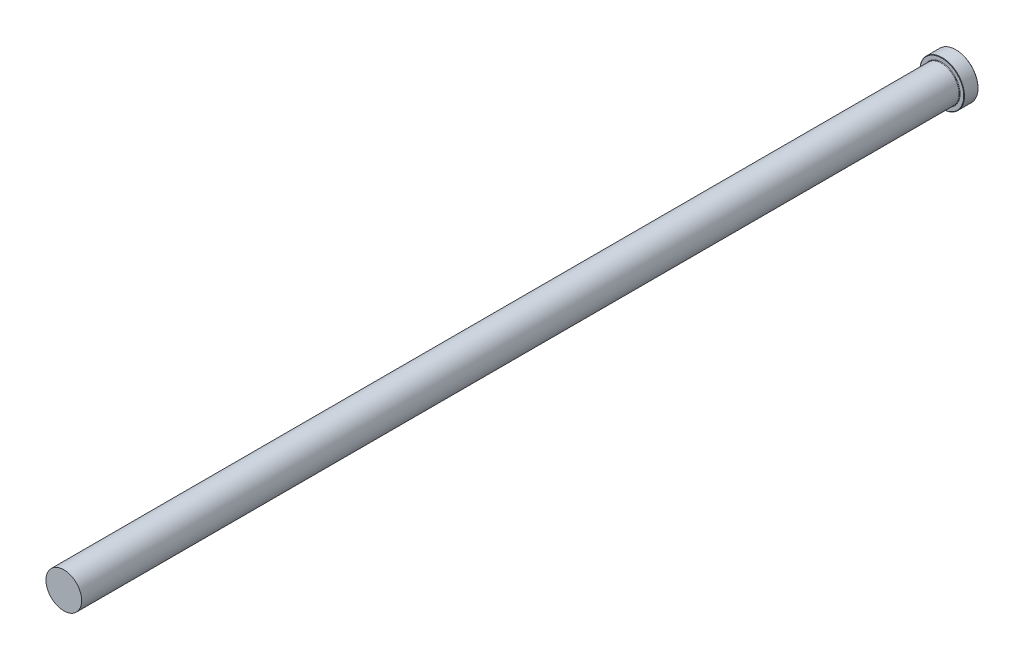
ISO-10303-21;
HEADER;
FILE_DESCRIPTION(('STEP AP214'),'2;1');
FILE_NAME('part.step','',(''),(''),'','','');
FILE_SCHEMA(('AUTOMOTIVE_DESIGN { 1 0 10303 214 1 1 1 1 }'));
ENDSEC;
DATA;
#1=APPLICATION_CONTEXT('core data for automotive mechanical design processes');
#2=APPLICATION_PROTOCOL_DEFINITION('international standard','automotive_design',2000,#1);
#3=PRODUCT_CONTEXT('',#1,'mechanical');
#4=PRODUCT('Part','Part','',(#3));
#5=PRODUCT_RELATED_PRODUCT_CATEGORY('part','',(#4));
#6=PRODUCT_DEFINITION_FORMATION('','',#4);
#7=PRODUCT_DEFINITION_CONTEXT('part definition',#1,'design');
#8=PRODUCT_DEFINITION('design','',#6,#7);
#9=PRODUCT_DEFINITION_SHAPE('','',#8);
#10=(LENGTH_UNIT() NAMED_UNIT(*) SI_UNIT(.MILLI.,.METRE.));
#11=(NAMED_UNIT(*) PLANE_ANGLE_UNIT() SI_UNIT($,.RADIAN.));
#12=(NAMED_UNIT(*) SI_UNIT($,.STERADIAN.) SOLID_ANGLE_UNIT());
#13=UNCERTAINTY_MEASURE_WITH_UNIT(LENGTH_MEASURE(1.E-05),#10,'distance_accuracy_value','');
#14=(GEOMETRIC_REPRESENTATION_CONTEXT(3) GLOBAL_UNCERTAINTY_ASSIGNED_CONTEXT((#13)) GLOBAL_UNIT_ASSIGNED_CONTEXT((#10,
#11,#12)) REPRESENTATION_CONTEXT('',''));
#15=CARTESIAN_POINT('',(0.,0.,0.));
#16=DIRECTION('',(0.,0.,1.));
#17=DIRECTION('',(1.,0.,0.));
#18=AXIS2_PLACEMENT_3D('',#15,#16,#17);
#19=CARTESIAN_POINT('',(0.,9.99999999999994,500.));
#20=DIRECTION('',(0.,0.,-1.));
#21=DIRECTION('',(-1.,0.,0.));
#22=AXIS2_PLACEMENT_3D('',#19,#20,#21);
#23=PLANE('',#22);
#24=CARTESIAN_POINT('',(0.,0.,500.));
#25=DIRECTION('',(0.,0.,1.));
#26=DIRECTION('',(1.,0.,0.));
#27=AXIS2_PLACEMENT_3D('',#24,#25,#26);
#28=CIRCLE('',#27,9.99999999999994);
#29=CARTESIAN_POINT('',(9.99999999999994,0.,500.));
#30=VERTEX_POINT('',#29);
#31=EDGE_CURVE('E50',#30,#30,#28,.T.);
#32=ORIENTED_EDGE('',*,*,#31,.T.);
#33=EDGE_LOOP('',(#32));
#34=FACE_BOUND('',#33,.T.);
#35=ADVANCED_FACE('F30',(#34),#23,.F.);
#36=CARTESIAN_POINT('',(0.,0.,109.050628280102));
#37=DIRECTION('',(0.,0.,1.));
#38=DIRECTION('',(1.,0.,0.));
#39=AXIS2_PLACEMENT_3D('',#36,#37,#38);
#40=CYLINDRICAL_SURFACE('',#39,9.99999999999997);
#41=ORIENTED_EDGE('',*,*,#31,.F.);
#42=EDGE_LOOP('',(#41));
#43=FACE_BOUND('',#42,.T.);
#44=CARTESIAN_POINT('',(0.,0.,8.3));
#45=DIRECTION('',(0.,0.,1.));
#46=DIRECTION('',(1.,0.,0.));
#47=AXIS2_PLACEMENT_3D('',#44,#45,#46);
#48=CIRCLE('',#47,10.);
#49=CARTESIAN_POINT('',(10.,0.,8.3));
#50=VERTEX_POINT('',#49);
#51=EDGE_CURVE('E53',#50,#50,#48,.T.);
#52=ORIENTED_EDGE('',*,*,#51,.T.);
#53=EDGE_LOOP('',(#52));
#54=FACE_BOUND('',#53,.T.);
#55=ADVANCED_FACE('F73',(#43,#54),#40,.T.);
#56=CARTESIAN_POINT('',(0.,0.,8.3));
#57=DIRECTION('',(0.,0.,1.));
#58=DIRECTION('',(1.,0.,0.));
#59=AXIS2_PLACEMENT_3D('',#56,#57,#58);
#60=TOROIDAL_SURFACE('',#59,10.3,0.3);
#61=ORIENTED_EDGE('',*,*,#51,.F.);
#62=EDGE_LOOP('',(#61));
#63=FACE_BOUND('',#62,.T.);
#64=CARTESIAN_POINT('',(0.,0.,8.00000000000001));
#65=DIRECTION('',(0.,0.,1.));
#66=DIRECTION('',(1.,0.,0.));
#67=AXIS2_PLACEMENT_3D('',#64,#65,#66);
#68=CIRCLE('',#67,10.3);
#69=CARTESIAN_POINT('',(10.3,0.,8.00000000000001));
#70=VERTEX_POINT('',#69);
#71=EDGE_CURVE('E56',#70,#70,#68,.T.);
#72=ORIENTED_EDGE('',*,*,#71,.T.);
#73=EDGE_LOOP('',(#72));
#74=FACE_BOUND('',#73,.T.);
#75=ADVANCED_FACE('F60',(#63,#74),#60,.F.);
#76=CARTESIAN_POINT('',(0.,12.5,8.));
#77=DIRECTION('',(0.,0.,-1.));
#78=DIRECTION('',(-1.,0.,0.));
#79=AXIS2_PLACEMENT_3D('',#76,#77,#78);
#80=PLANE('',#79);
#81=CARTESIAN_POINT('',(0.,0.,8.));
#82=DIRECTION('',(0.,0.,-1.));
#83=DIRECTION('',(-1.,0.,0.));
#84=AXIS2_PLACEMENT_3D('',#81,#82,#83);
#85=CIRCLE('',#84,12.3000000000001);
#86=CARTESIAN_POINT('',(-12.3000000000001,0.,8.));
#87=VERTEX_POINT('',#86);
#88=EDGE_CURVE('E10',#87,#87,#85,.F.);
#89=ORIENTED_EDGE('',*,*,#88,.T.);
#90=EDGE_LOOP('',(#89));
#91=FACE_BOUND('',#90,.T.);
#92=ORIENTED_EDGE('',*,*,#71,.F.);
#93=EDGE_LOOP('',(#92));
#94=FACE_BOUND('',#93,.T.);
#95=ADVANCED_FACE('F62',(#91,#94),#80,.F.);
#96=CARTESIAN_POINT('',(0.,0.,109.050628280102));
#97=DIRECTION('',(0.,0.,1.));
#98=DIRECTION('',(1.,0.,0.));
#99=AXIS2_PLACEMENT_3D('',#96,#97,#98);
#100=CYLINDRICAL_SURFACE('',#99,12.5);
#101=CARTESIAN_POINT('',(0.,0.,0.200000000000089));
#102=DIRECTION('',(0.,0.,1.));
#103=DIRECTION('',(1.,0.,0.));
#104=AXIS2_PLACEMENT_3D('',#101,#102,#103);
#105=CIRCLE('',#104,12.5);
#106=CARTESIAN_POINT('',(12.5,0.,0.200000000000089));
#107=VERTEX_POINT('',#106);
#108=EDGE_CURVE('E41',#107,#107,#105,.T.);
#109=ORIENTED_EDGE('',*,*,#108,.T.);
#110=EDGE_LOOP('',(#109));
#111=FACE_BOUND('',#110,.T.);
#112=CARTESIAN_POINT('',(0.,0.,7.80000000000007));
#113=DIRECTION('',(0.,0.,-1.));
#114=DIRECTION('',(-1.,0.,0.));
#115=AXIS2_PLACEMENT_3D('',#112,#113,#114);
#116=CIRCLE('',#115,12.5);
#117=CARTESIAN_POINT('',(-12.5,0.,7.80000000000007));
#118=VERTEX_POINT('',#117);
#119=EDGE_CURVE('E45',#118,#118,#116,.T.);
#120=ORIENTED_EDGE('',*,*,#119,.T.);
#121=EDGE_LOOP('',(#120));
#122=FACE_BOUND('',#121,.T.);
#123=ADVANCED_FACE('F64',(#111,#122),#100,.T.);
#124=CARTESIAN_POINT('',(0.,0.,0.));
#125=DIRECTION('',(0.,0.,1.));
#126=DIRECTION('',(1.,0.,0.));
#127=AXIS2_PLACEMENT_3D('',#124,#125,#126);
#128=PLANE('',#127);
#129=CARTESIAN_POINT('',(0.,0.,0.));
#130=DIRECTION('',(0.,0.,1.));
#131=DIRECTION('',(1.,0.,0.));
#132=AXIS2_PLACEMENT_3D('',#129,#130,#131);
#133=CIRCLE('',#132,12.2999999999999);
#134=CARTESIAN_POINT('',(12.2999999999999,0.,0.));
#135=VERTEX_POINT('',#134);
#136=EDGE_CURVE('E37',#135,#135,#133,.F.);
#137=ORIENTED_EDGE('',*,*,#136,.T.);
#138=EDGE_LOOP('',(#137));
#139=FACE_BOUND('',#138,.T.);
#140=ADVANCED_FACE('F70',(#139),#128,.F.);
#141=CARTESIAN_POINT('',(0.,0.,0.200000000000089));
#142=DIRECTION('',(0.,0.,1.));
#143=DIRECTION('',(1.,0.,0.));
#144=AXIS2_PLACEMENT_3D('',#141,#142,#143);
#145=CONICAL_SURFACE('',#144,12.5,0.785398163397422);
#146=ORIENTED_EDGE('',*,*,#136,.F.);
#147=EDGE_LOOP('',(#146));
#148=FACE_BOUND('',#147,.T.);
#149=ORIENTED_EDGE('',*,*,#108,.F.);
#150=EDGE_LOOP('',(#149));
#151=FACE_BOUND('',#150,.T.);
#152=ADVANCED_FACE('F84',(#148,#151),#145,.T.);
#153=CARTESIAN_POINT('',(0.,0.,8.00000000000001));
#154=DIRECTION('',(0.,0.,-1.));
#155=DIRECTION('',(-1.,0.,0.));
#156=AXIS2_PLACEMENT_3D('',#153,#154,#155);
#157=CONICAL_SURFACE('',#156,12.3000000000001,0.785398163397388);
#158=ORIENTED_EDGE('',*,*,#119,.F.);
#159=EDGE_LOOP('',(#158));
#160=FACE_BOUND('',#159,.T.);
#161=ORIENTED_EDGE('',*,*,#88,.F.);
#162=EDGE_LOOP('',(#161));
#163=FACE_BOUND('',#162,.T.);
#164=ADVANCED_FACE('F32',(#160,#163),#157,.T.);
#165=CLOSED_SHELL('',(#35,#55,#75,#95,#123,#140,#152,#164));
#166=MANIFOLD_SOLID_BREP('B2',#165);
#167=ADVANCED_BREP_SHAPE_REPRESENTATION('',(#18,#166),#14);
#168=SHAPE_DEFINITION_REPRESENTATION(#9,#167);
ENDSEC;
END-ISO-10303-21;
